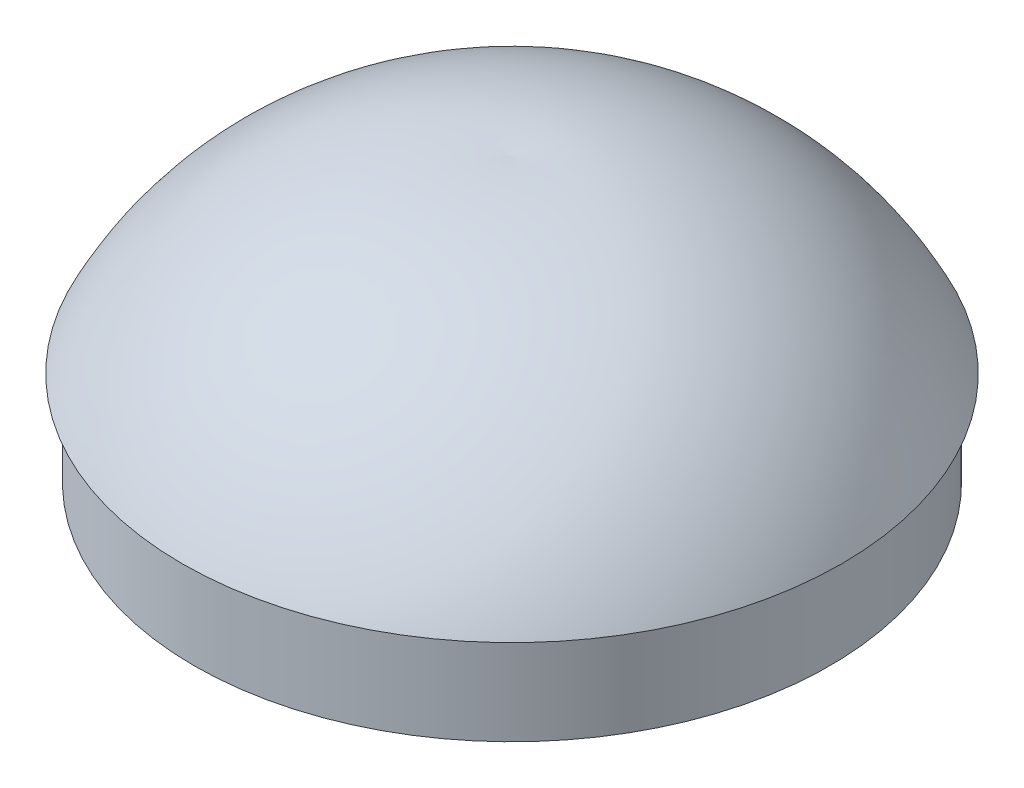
ISO-10303-21;
HEADER;
FILE_DESCRIPTION(('STEP AP214'),'2;1');
FILE_NAME('part.step','',(''),(''),'','','');
FILE_SCHEMA(('AUTOMOTIVE_DESIGN { 1 0 10303 214 1 1 1 1 }'));
ENDSEC;
DATA;
#1=APPLICATION_CONTEXT('core data for automotive mechanical design processes');
#2=APPLICATION_PROTOCOL_DEFINITION('international standard','automotive_design',2000,#1);
#3=PRODUCT_CONTEXT('',#1,'mechanical');
#4=PRODUCT('Part','Part','',(#3));
#5=PRODUCT_RELATED_PRODUCT_CATEGORY('part','',(#4));
#6=PRODUCT_DEFINITION_FORMATION('','',#4);
#7=PRODUCT_DEFINITION_CONTEXT('part definition',#1,'design');
#8=PRODUCT_DEFINITION('design','',#6,#7);
#9=PRODUCT_DEFINITION_SHAPE('','',#8);
#10=(LENGTH_UNIT() NAMED_UNIT(*) SI_UNIT(.MILLI.,.METRE.));
#11=(NAMED_UNIT(*) PLANE_ANGLE_UNIT() SI_UNIT($,.RADIAN.));
#12=(NAMED_UNIT(*) SI_UNIT($,.STERADIAN.) SOLID_ANGLE_UNIT());
#13=UNCERTAINTY_MEASURE_WITH_UNIT(LENGTH_MEASURE(1.E-05),#10,'distance_accuracy_value','');
#14=(GEOMETRIC_REPRESENTATION_CONTEXT(3) GLOBAL_UNCERTAINTY_ASSIGNED_CONTEXT((#13)) GLOBAL_UNIT_ASSIGNED_CONTEXT((#10,
#11,#12)) REPRESENTATION_CONTEXT('',''));
#15=CARTESIAN_POINT('',(0.,0.,0.));
#16=DIRECTION('',(0.,0.,1.));
#17=DIRECTION('',(1.,0.,0.));
#18=AXIS2_PLACEMENT_3D('',#15,#16,#17);
#19=CARTESIAN_POINT('',(0.,-40.5671652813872,-6.75447698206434));
#20=DIRECTION('',(-1.,0.,0.));
#21=DIRECTION('',(0.,0.,-1.));
#22=AXIS2_PLACEMENT_3D('',#19,#20,#21);
#23=CIRCLE('',#22,86.5364933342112);
#24=TRIMMED_CURVE('',#23,(PARAMETER_VALUE(-1.64892930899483)),
(PARAMETER_VALUE(1.64892930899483)),.T.,.PARAMETER.);
#25=CARTESIAN_POINT('',(0.,-40.5671652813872,0.));
#26=DIRECTION('',(0.,-1.,0.));
#27=AXIS1_PLACEMENT('',#25,#26);
#28=SURFACE_OF_REVOLUTION('',#24,#27);
#29=CARTESIAN_POINT('',(0.,0.,0.));
#30=DIRECTION('',(0.,-1.,0.));
#31=DIRECTION('',(0.,0.,-1.));
#32=AXIS2_PLACEMENT_3D('',#29,#30,#31);
#33=CIRCLE('',#32,83.1931437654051);
#34=CARTESIAN_POINT('',(0.,0.,-83.1931437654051));
#35=VERTEX_POINT('',#34);
#36=EDGE_CURVE('E74',#35,#35,#33,.T.);
#37=ORIENTED_EDGE('',*,*,#36,.T.);
#38=EDGE_LOOP('',(#37));
#39=FACE_BOUND('',#38,.T.);
#40=CARTESIAN_POINT('',(0.,45.7053200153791,0.));
#41=VERTEX_POINT('',#40);
#42=VERTEX_LOOP('',#41);
#43=FACE_BOUND('',#42,.T.);
#44=ADVANCED_FACE('F17',(#39,#43),#28,.F.);
#45=CARTESIAN_POINT('',(0.,0.,0.));
#46=DIRECTION('',(0.,-1.,0.));
#47=DIRECTION('',(0.,0.,-1.));
#48=AXIS2_PLACEMENT_3D('',#45,#46,#47);
#49=CYLINDRICAL_SURFACE('',#48,83.1931437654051);
#50=ORIENTED_EDGE('',*,*,#36,.F.);
#51=EDGE_LOOP('',(#50));
#52=FACE_BOUND('',#51,.T.);
#53=CARTESIAN_POINT('',(0.,-25.4,0.));
#54=DIRECTION('',(0.,-1.,0.));
#55=DIRECTION('',(0.,0.,-1.));
#56=AXIS2_PLACEMENT_3D('',#53,#54,#55);
#57=CIRCLE('',#56,83.1931437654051);
#58=CARTESIAN_POINT('',(0.,-25.4,-83.1931437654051));
#59=VERTEX_POINT('',#58);
#60=EDGE_CURVE('E21',#59,#59,#57,.T.);
#61=ORIENTED_EDGE('',*,*,#60,.T.);
#62=EDGE_LOOP('',(#61));
#63=FACE_BOUND('',#62,.T.);
#64=ADVANCED_FACE('F34',(#52,#63),#49,.F.);
#65=CARTESIAN_POINT('',(0.,-25.4,0.));
#66=DIRECTION('',(0.,1.,0.));
#67=DIRECTION('',(0.,0.,1.));
#68=AXIS2_PLACEMENT_3D('',#65,#66,#67);
#69=PLANE('',#68);
#70=ORIENTED_EDGE('',*,*,#60,.F.);
#71=EDGE_LOOP('',(#70));
#72=FACE_BOUND('',#71,.T.);
#73=CARTESIAN_POINT('',(0.,-25.4,0.));
#74=DIRECTION('',(0.,-1.,0.));
#75=DIRECTION('',(0.,0.,-1.));
#76=AXIS2_PLACEMENT_3D('',#73,#74,#75);
#77=CIRCLE('',#76,85.725);
#78=CARTESIAN_POINT('',(0.,-25.4,-85.725));
#79=VERTEX_POINT('',#78);
#80=EDGE_CURVE('E71',#79,#79,#77,.F.);
#81=ORIENTED_EDGE('',*,*,#80,.F.);
#82=EDGE_LOOP('',(#81));
#83=FACE_BOUND('',#82,.T.);
#84=ADVANCED_FACE('F40',(#72,#83),#69,.F.);
#85=CARTESIAN_POINT('',(0.,0.,0.));
#86=DIRECTION('',(0.,-1.,0.));
#87=DIRECTION('',(0.,0.,-1.));
#88=AXIS2_PLACEMENT_3D('',#85,#86,#87);
#89=CYLINDRICAL_SURFACE('',#88,85.725);
#90=CARTESIAN_POINT('',(0.,0.,0.));
#91=DIRECTION('',(0.,-1.,0.));
#92=DIRECTION('',(0.,0.,-1.));
#93=AXIS2_PLACEMENT_3D('',#90,#91,#92);
#94=CIRCLE('',#93,85.725);
#95=CARTESIAN_POINT('',(0.,0.,-85.725));
#96=VERTEX_POINT('',#95);
#97=EDGE_CURVE('E27',#96,#96,#94,.F.);
#98=ORIENTED_EDGE('',*,*,#97,.F.);
#99=EDGE_LOOP('',(#98));
#100=FACE_BOUND('',#99,.T.);
#101=ORIENTED_EDGE('',*,*,#80,.T.);
#102=EDGE_LOOP('',(#101));
#103=FACE_BOUND('',#102,.T.);
#104=ADVANCED_FACE('F50',(#100,#103),#89,.T.);
#105=CARTESIAN_POINT('',(0.,0.,0.));
#106=DIRECTION('',(0.,-1.,0.));
#107=DIRECTION('',(0.,0.,-1.));
#108=AXIS2_PLACEMENT_3D('',#105,#106,#107);
#109=PLANE('',#108);
#110=ORIENTED_EDGE('',*,*,#97,.T.);
#111=EDGE_LOOP('',(#110));
#112=FACE_BOUND('',#111,.T.);
#113=CARTESIAN_POINT('',(0.,0.,0.));
#114=DIRECTION('',(0.,-1.,0.));
#115=DIRECTION('',(0.,0.,-1.));
#116=AXIS2_PLACEMENT_3D('',#113,#114,#115);
#117=CIRCLE('',#116,88.9);
#118=CARTESIAN_POINT('',(0.,0.,-88.9));
#119=VERTEX_POINT('',#118);
#120=EDGE_CURVE('E11',#119,#119,#117,.T.);
#121=ORIENTED_EDGE('',*,*,#120,.T.);
#122=EDGE_LOOP('',(#121));
#123=FACE_BOUND('',#122,.T.);
#124=ADVANCED_FACE('F45',(#112,#123),#109,.T.);
#125=CARTESIAN_POINT('',(0.,-40.5671652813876,-6.75447698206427));
#126=DIRECTION('',(-1.,0.,0.));
#127=DIRECTION('',(0.,0.,-1.));
#128=AXIS2_PLACEMENT_3D('',#125,#126,#127);
#129=CIRCLE('',#128,91.6164933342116);
#130=TRIMMED_CURVE('',#129,(PARAMETER_VALUE(-1.64458883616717)),
(PARAMETER_VALUE(1.64458883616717)),.T.,.PARAMETER.);
#131=CARTESIAN_POINT('',(0.,-40.5671652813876,0.));
#132=DIRECTION('',(0.,-1.,0.));
#133=AXIS1_PLACEMENT('',#131,#132);
#134=SURFACE_OF_REVOLUTION('',#130,#133);
#135=ORIENTED_EDGE('',*,*,#120,.F.);
#136=EDGE_LOOP('',(#135));
#137=FACE_BOUND('',#136,.T.);
#138=CARTESIAN_POINT('',(0.,50.8,0.));
#139=VERTEX_POINT('',#138);
#140=VERTEX_LOOP('',#139);
#141=FACE_BOUND('',#140,.T.);
#142=ADVANCED_FACE('F19',(#137,#141),#134,.T.);
#143=CLOSED_SHELL('',(#44,#64,#84,#104,#124,#142));
#144=MANIFOLD_SOLID_BREP('B1',#143);
#145=ADVANCED_BREP_SHAPE_REPRESENTATION('',(#18,#144),#14);
#146=SHAPE_DEFINITION_REPRESENTATION(#9,#145);
ENDSEC;
END-ISO-10303-21;
